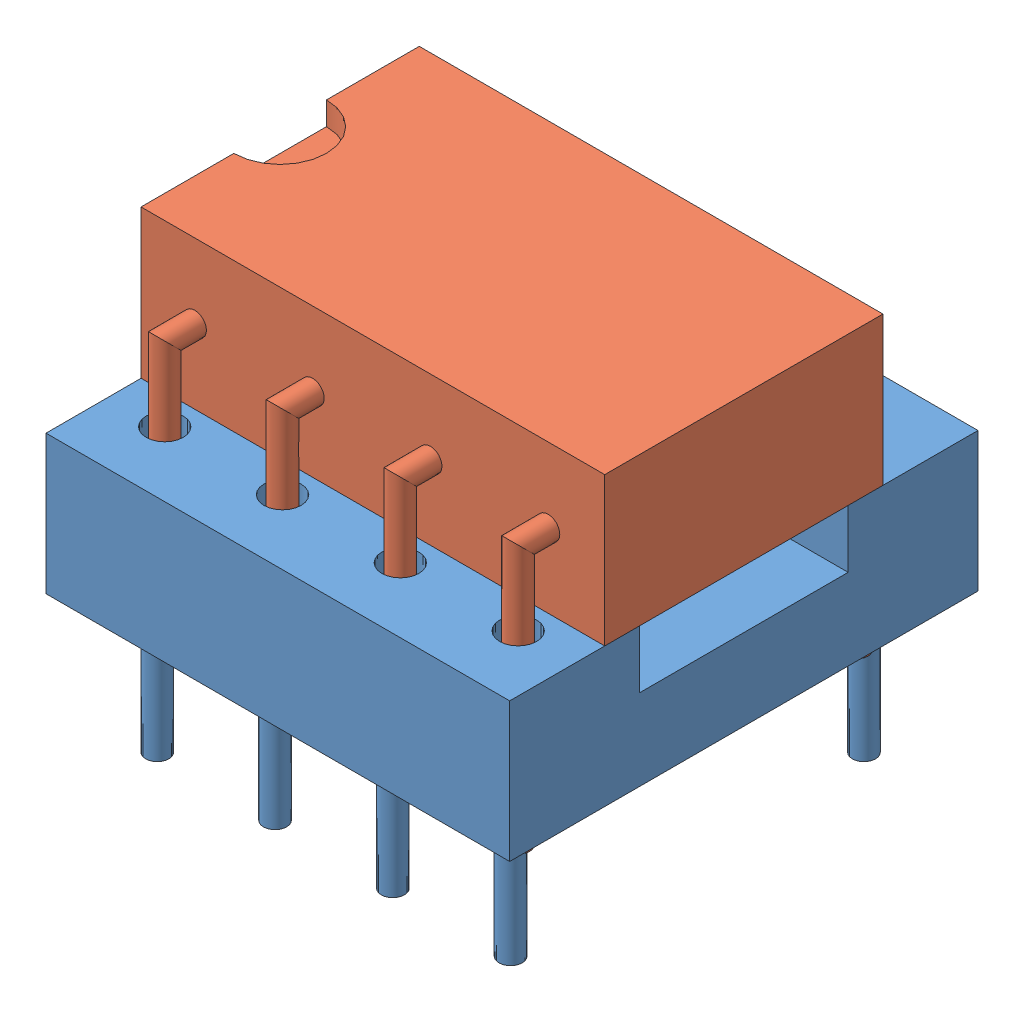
SolidWorks assembly Sup 8 pat avec CI.SLDASM, configuration Défaut (file format 4700). Lengths in mm.
Overall size (10 9.2 10.1).
2 component instances, 2 part files, 3 mates.
Components (placement in the parent):
- Support CI 8 pattes-1: Support CI 8 pattes.SLDPRT [Défaut] at (-5.2672 -0.549 0) size (10 6 10.1)
- CI 8 pattes-2: CI 8 pattes.SLDPRT [Défaut] at (-5.2672 2.451 0) size (10 7.2 7.8)
Mates (geometry in assembly coordinates):
- Coïncidente5: coincident: axis of Support CI 8 pattes-1 through (-4.1072 -0.049 3.65) axis (0 1 0); axis of CI 8 pattes-2 through (-4.1072 4.301 3.65) axis (0 -1 0)
- Coïncidente6: coincident: axis of Support CI 8 pattes-1 through (-4.1072 -0.049 -3.65) axis (0 1 0); axis of CI 8 pattes-2 through (-4.1072 4.301 -3.65) axis (0 -1 0)
- Coïncidente7: coincident: plane of Support CI 8 pattes-1 through (4.7328 2.451 -5.05) normal (0 1 0); line of CI 8 pattes-2 through (-5.2672 2.451 3) axis (0 0 -1)
